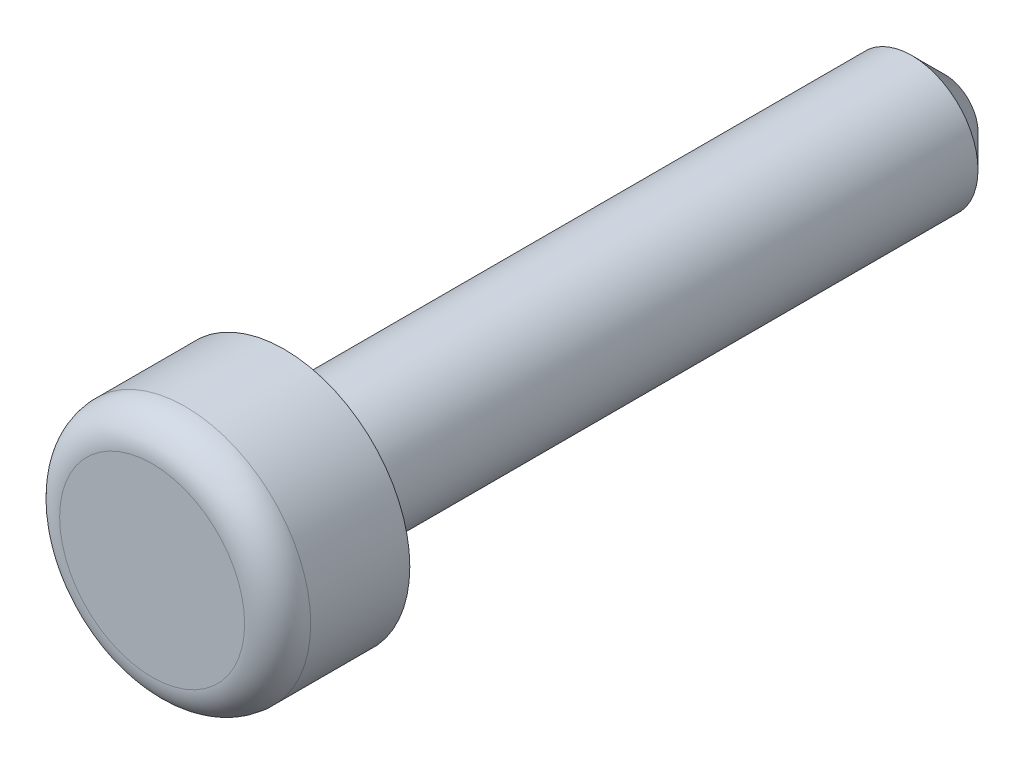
ISO-10303-21;
HEADER;
FILE_DESCRIPTION(('STEP AP214'),'2;1');
FILE_NAME('part.step','',(''),(''),'','','');
FILE_SCHEMA(('AUTOMOTIVE_DESIGN { 1 0 10303 214 1 1 1 1 }'));
ENDSEC;
DATA;
#1=APPLICATION_CONTEXT('core data for automotive mechanical design processes');
#2=APPLICATION_PROTOCOL_DEFINITION('international standard','automotive_design',2000,#1);
#3=PRODUCT_CONTEXT('',#1,'mechanical');
#4=PRODUCT('Part','Part','',(#3));
#5=PRODUCT_RELATED_PRODUCT_CATEGORY('part','',(#4));
#6=PRODUCT_DEFINITION_FORMATION('','',#4);
#7=PRODUCT_DEFINITION_CONTEXT('part definition',#1,'design');
#8=PRODUCT_DEFINITION('design','',#6,#7);
#9=PRODUCT_DEFINITION_SHAPE('','',#8);
#10=(LENGTH_UNIT() NAMED_UNIT(*) SI_UNIT(.MILLI.,.METRE.));
#11=(NAMED_UNIT(*) PLANE_ANGLE_UNIT() SI_UNIT($,.RADIAN.));
#12=(NAMED_UNIT(*) SI_UNIT($,.STERADIAN.) SOLID_ANGLE_UNIT());
#13=UNCERTAINTY_MEASURE_WITH_UNIT(LENGTH_MEASURE(1.E-05),#10,'distance_accuracy_value','');
#14=(GEOMETRIC_REPRESENTATION_CONTEXT(3) GLOBAL_UNCERTAINTY_ASSIGNED_CONTEXT((#13)) GLOBAL_UNIT_ASSIGNED_CONTEXT((#10,
#11,#12)) REPRESENTATION_CONTEXT('',''));
#15=CARTESIAN_POINT('',(0.,0.,0.));
#16=DIRECTION('',(0.,0.,1.));
#17=DIRECTION('',(1.,0.,0.));
#18=AXIS2_PLACEMENT_3D('',#15,#16,#17);
#19=CARTESIAN_POINT('',(0.,0.,2.));
#20=DIRECTION('',(0.,0.,1.));
#21=DIRECTION('',(1.,0.,0.));
#22=AXIS2_PLACEMENT_3D('',#19,#20,#21);
#23=PLANE('',#22);
#24=CARTESIAN_POINT('',(0.,0.,2.));
#25=DIRECTION('',(0.,0.,-1.));
#26=DIRECTION('',(1.,0.,0.));
#27=AXIS2_PLACEMENT_3D('',#24,#25,#26);
#28=CIRCLE('',#27,1.4);
#29=CARTESIAN_POINT('',(1.4,0.,2.));
#30=VERTEX_POINT('',#29);
#31=CARTESIAN_POINT('',(-1.4,0.,2.));
#32=VERTEX_POINT('',#31);
#33=EDGE_CURVE('E37',#30,#32,#28,.T.);
#34=ORIENTED_EDGE('',*,*,#33,.F.);
#35=CARTESIAN_POINT('',(0.,0.,2.));
#36=DIRECTION('',(0.,0.,-1.));
#37=DIRECTION('',(-1.,0.,0.));
#38=AXIS2_PLACEMENT_3D('',#35,#36,#37);
#39=CIRCLE('',#38,1.4);
#40=EDGE_CURVE('E33',#32,#30,#39,.T.);
#41=ORIENTED_EDGE('',*,*,#40,.F.);
#42=EDGE_LOOP('',(#34,#41));
#43=FACE_BOUND('',#42,.T.);
#44=ADVANCED_FACE('F16',(#43),#23,.T.);
#45=CARTESIAN_POINT('',(0.,0.,1.5));
#46=DIRECTION('',(0.,0.,1.));
#47=DIRECTION('',(1.,0.,0.));
#48=AXIS2_PLACEMENT_3D('',#45,#46,#47);
#49=TOROIDAL_SURFACE('',#48,1.4,0.5);
#50=CARTESIAN_POINT('',(0.,0.,1.5));
#51=DIRECTION('',(0.,0.,1.));
#52=DIRECTION('',(1.,0.,0.));
#53=AXIS2_PLACEMENT_3D('',#50,#51,#52);
#54=CIRCLE('',#53,1.9);
#55=CARTESIAN_POINT('',(1.9,0.,1.5));
#56=VERTEX_POINT('',#55);
#57=EDGE_CURVE('E43',#56,#56,#54,.F.);
#58=ORIENTED_EDGE('',*,*,#57,.F.);
#59=EDGE_LOOP('',(#58));
#60=FACE_BOUND('',#59,.T.);
#61=ORIENTED_EDGE('',*,*,#33,.T.);
#62=ORIENTED_EDGE('',*,*,#40,.T.);
#63=EDGE_LOOP('',(#61,#62));
#64=FACE_BOUND('',#63,.T.);
#65=ADVANCED_FACE('F42',(#60,#64),#49,.T.);
#66=CARTESIAN_POINT('',(0.,0.,-10.));
#67=DIRECTION('',(0.,0.,-1.));
#68=DIRECTION('',(-1.,0.,0.));
#69=AXIS2_PLACEMENT_3D('',#66,#67,#68);
#70=PLANE('',#69);
#71=CARTESIAN_POINT('',(0.,0.,-9.99999999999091));
#72=DIRECTION('',(0.,0.,1.));
#73=DIRECTION('',(1.,0.,0.));
#74=AXIS2_PLACEMENT_3D('',#71,#72,#73);
#75=CIRCLE('',#74,0.499999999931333);
#76=CARTESIAN_POINT('',(0.499999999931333,0.,-9.99999999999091));
#77=VERTEX_POINT('',#76);
#78=EDGE_CURVE('E74',#77,#77,#75,.T.);
#79=ORIENTED_EDGE('',*,*,#78,.F.);
#80=EDGE_LOOP('',(#79));
#81=FACE_BOUND('',#80,.T.);
#82=ADVANCED_FACE('F59',(#81),#70,.T.);
#83=CARTESIAN_POINT('',(0.,0.,0.));
#84=DIRECTION('',(0.,0.,1.));
#85=DIRECTION('',(1.,0.,0.));
#86=AXIS2_PLACEMENT_3D('',#83,#84,#85);
#87=CYLINDRICAL_SURFACE('',#86,1.9);
#88=ORIENTED_EDGE('',*,*,#57,.T.);
#89=EDGE_LOOP('',(#88));
#90=FACE_BOUND('',#89,.T.);
#91=CARTESIAN_POINT('',(0.,0.,0.));
#92=DIRECTION('',(0.,0.,1.));
#93=DIRECTION('',(1.,0.,0.));
#94=AXIS2_PLACEMENT_3D('',#91,#92,#93);
#95=CIRCLE('',#94,1.9);
#96=CARTESIAN_POINT('',(1.9,0.,0.));
#97=VERTEX_POINT('',#96);
#98=EDGE_CURVE('E76',#97,#97,#95,.T.);
#99=ORIENTED_EDGE('',*,*,#98,.T.);
#100=EDGE_LOOP('',(#99));
#101=FACE_BOUND('',#100,.T.);
#102=ADVANCED_FACE('F89',(#90,#101),#87,.T.);
#103=CARTESIAN_POINT('',(0.,0.,-9.50000000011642));
#104=DIRECTION('',(0.,0.,1.));
#105=DIRECTION('',(1.,0.,0.));
#106=AXIS2_PLACEMENT_3D('',#103,#104,#105);
#107=CONICAL_SURFACE('',#106,0.999999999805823,0.785398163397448);
#108=CARTESIAN_POINT('',(0.,0.,-9.5));
#109=DIRECTION('',(0.,0.,-1.));
#110=DIRECTION('',(-1.,0.,0.));
#111=AXIS2_PLACEMENT_3D('',#108,#109,#110);
#112=CIRCLE('',#111,1.);
#113=CARTESIAN_POINT('',(-1.,0.,-9.5));
#114=VERTEX_POINT('',#113);
#115=EDGE_CURVE('E27',#114,#114,#112,.F.);
#116=ORIENTED_EDGE('',*,*,#115,.F.);
#117=EDGE_LOOP('',(#116));
#118=FACE_BOUND('',#117,.T.);
#119=ORIENTED_EDGE('',*,*,#78,.T.);
#120=EDGE_LOOP('',(#119));
#121=FACE_BOUND('',#120,.T.);
#122=ADVANCED_FACE('F86',(#118,#121),#107,.T.);
#123=CARTESIAN_POINT('',(0.,0.,0.));
#124=DIRECTION('',(0.,0.,1.));
#125=DIRECTION('',(1.,0.,0.));
#126=AXIS2_PLACEMENT_3D('',#123,#124,#125);
#127=PLANE('',#126);
#128=CARTESIAN_POINT('',(0.,0.,0.));
#129=DIRECTION('',(0.,0.,-1.));
#130=DIRECTION('',(-1.,0.,0.));
#131=AXIS2_PLACEMENT_3D('',#128,#129,#130);
#132=CIRCLE('',#131,1.);
#133=CARTESIAN_POINT('',(-1.,0.,0.));
#134=VERTEX_POINT('',#133);
#135=EDGE_CURVE('E11',#134,#134,#132,.T.);
#136=ORIENTED_EDGE('',*,*,#135,.F.);
#137=EDGE_LOOP('',(#136));
#138=FACE_BOUND('',#137,.T.);
#139=ORIENTED_EDGE('',*,*,#98,.F.);
#140=EDGE_LOOP('',(#139));
#141=FACE_BOUND('',#140,.T.);
#142=ADVANCED_FACE('F97',(#138,#141),#127,.F.);
#143=CARTESIAN_POINT('',(0.,0.,0.));
#144=DIRECTION('',(0.,0.,-1.));
#145=DIRECTION('',(-1.,0.,0.));
#146=AXIS2_PLACEMENT_3D('',#143,#144,#145);
#147=CYLINDRICAL_SURFACE('',#146,1.);
#148=ORIENTED_EDGE('',*,*,#115,.T.);
#149=EDGE_LOOP('',(#148));
#150=FACE_BOUND('',#149,.T.);
#151=ORIENTED_EDGE('',*,*,#135,.T.);
#152=EDGE_LOOP('',(#151));
#153=FACE_BOUND('',#152,.T.);
#154=ADVANCED_FACE('F95',(#150,#153),#147,.T.);
#155=CLOSED_SHELL('',(#44,#65,#82,#102,#122,#142,#154));
#156=MANIFOLD_SOLID_BREP('B1',#155);
#157=ADVANCED_BREP_SHAPE_REPRESENTATION('',(#18,#156),#14);
#158=SHAPE_DEFINITION_REPRESENTATION(#9,#157);
ENDSEC;
END-ISO-10303-21;
